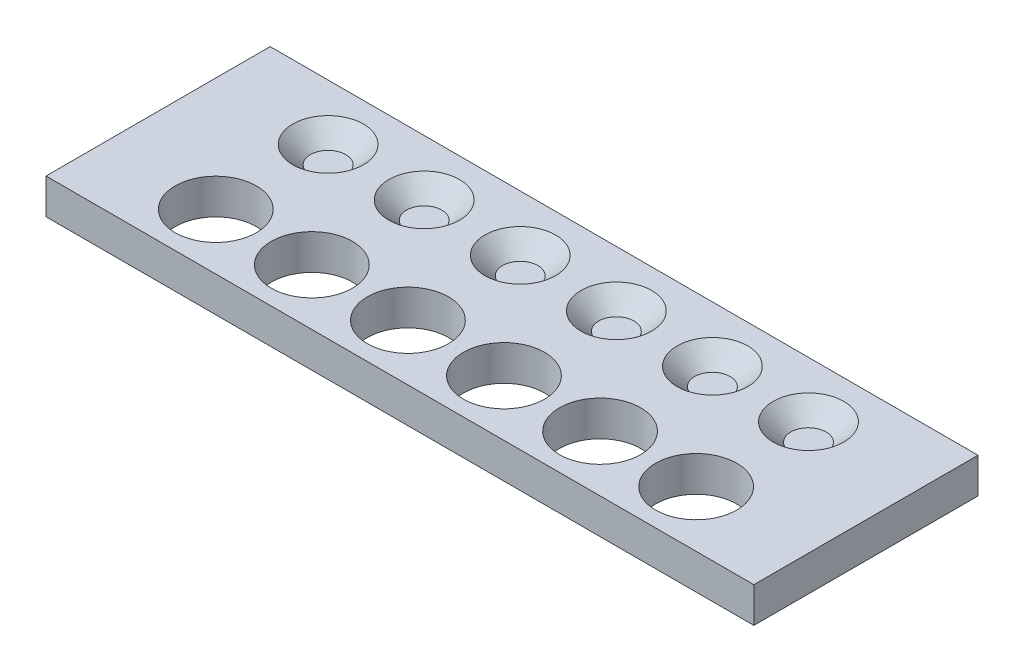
ISO-10303-21;
HEADER;
FILE_DESCRIPTION(('STEP AP214'),'2;1');
FILE_NAME('part.step','',(''),(''),'','','');
FILE_SCHEMA(('AUTOMOTIVE_DESIGN { 1 0 10303 214 1 1 1 1 }'));
ENDSEC;
DATA;
#1=APPLICATION_CONTEXT('core data for automotive mechanical design processes');
#2=APPLICATION_PROTOCOL_DEFINITION('international standard','automotive_design',2000,#1);
#3=PRODUCT_CONTEXT('',#1,'mechanical');
#4=PRODUCT('Part','Part','',(#3));
#5=PRODUCT_RELATED_PRODUCT_CATEGORY('part','',(#4));
#6=PRODUCT_DEFINITION_FORMATION('','',#4);
#7=PRODUCT_DEFINITION_CONTEXT('part definition',#1,'design');
#8=PRODUCT_DEFINITION('design','',#6,#7);
#9=PRODUCT_DEFINITION_SHAPE('','',#8);
#10=(LENGTH_UNIT() NAMED_UNIT(*) SI_UNIT(.MILLI.,.METRE.));
#11=(NAMED_UNIT(*) PLANE_ANGLE_UNIT() SI_UNIT($,.RADIAN.));
#12=(NAMED_UNIT(*) SI_UNIT($,.STERADIAN.) SOLID_ANGLE_UNIT());
#13=UNCERTAINTY_MEASURE_WITH_UNIT(LENGTH_MEASURE(1.E-05),#10,'distance_accuracy_value','');
#14=(GEOMETRIC_REPRESENTATION_CONTEXT(3) GLOBAL_UNCERTAINTY_ASSIGNED_CONTEXT((#13)) GLOBAL_UNIT_ASSIGNED_CONTEXT((#10,
#11,#12)) REPRESENTATION_CONTEXT('',''));
#15=CARTESIAN_POINT('',(0.,0.,0.));
#16=DIRECTION('',(0.,0.,1.));
#17=DIRECTION('',(1.,0.,0.));
#18=AXIS2_PLACEMENT_3D('',#15,#16,#17);
#19=CARTESIAN_POINT('',(-55.2242907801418,10.,-42.81280535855));
#20=DIRECTION('',(0.,-1.,0.));
#21=DIRECTION('',(0.,0.,-1.));
#22=AXIS2_PLACEMENT_3D('',#19,#20,#21);
#23=PLANE('',#22);
#24=CARTESIAN_POINT('',(108.050871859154,10.,-27.0217559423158));
#25=DIRECTION('',(0.,-1.,0.));
#26=DIRECTION('',(0.,0.,-1.));
#27=AXIS2_PLACEMENT_3D('',#24,#25,#26);
#28=CIRCLE('',#27,10.);
#29=CARTESIAN_POINT('',(108.050871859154,10.,-37.0217559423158));
#30=VERTEX_POINT('',#29);
#31=EDGE_CURVE('E11',#30,#30,#28,.T.);
#32=ORIENTED_EDGE('',*,*,#31,.T.);
#33=EDGE_LOOP('',(#32));
#34=FACE_BOUND('',#33,.T.);
#35=CARTESIAN_POINT('',(80.8366718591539,10.,-27.0217559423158));
#36=DIRECTION('',(0.,-1.,0.));
#37=DIRECTION('',(0.,0.,-1.));
#38=AXIS2_PLACEMENT_3D('',#35,#36,#37);
#39=CIRCLE('',#38,10.);
#40=CARTESIAN_POINT('',(80.8366718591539,10.,-37.0217559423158));
#41=VERTEX_POINT('',#40);
#42=EDGE_CURVE('E40',#41,#41,#39,.T.);
#43=ORIENTED_EDGE('',*,*,#42,.T.);
#44=EDGE_LOOP('',(#43));
#45=FACE_BOUND('',#44,.T.);
#46=CARTESIAN_POINT('',(53.6224718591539,10.,-27.0217559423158));
#47=DIRECTION('',(0.,-1.,0.));
#48=DIRECTION('',(0.,0.,-1.));
#49=AXIS2_PLACEMENT_3D('',#46,#47,#48);
#50=CIRCLE('',#49,10.);
#51=CARTESIAN_POINT('',(53.6224718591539,10.,-37.0217559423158));
#52=VERTEX_POINT('',#51);
#53=EDGE_CURVE('E171',#52,#52,#50,.T.);
#54=ORIENTED_EDGE('',*,*,#53,.T.);
#55=EDGE_LOOP('',(#54));
#56=FACE_BOUND('',#55,.T.);
#57=CARTESIAN_POINT('',(26.4076718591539,10.,-27.0217559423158));
#58=DIRECTION('',(0.,-1.,0.));
#59=DIRECTION('',(0.,0.,-1.));
#60=AXIS2_PLACEMENT_3D('',#57,#58,#59);
#61=CIRCLE('',#60,10.);
#62=CARTESIAN_POINT('',(26.4076718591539,10.,-37.0217559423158));
#63=VERTEX_POINT('',#62);
#64=EDGE_CURVE('E168',#63,#63,#61,.T.);
#65=ORIENTED_EDGE('',*,*,#64,.T.);
#66=EDGE_LOOP('',(#65));
#67=FACE_BOUND('',#66,.T.);
#68=CARTESIAN_POINT('',(-0.806528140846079,10.,-27.0217559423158));
#69=DIRECTION('',(0.,-1.,0.));
#70=DIRECTION('',(0.,0.,-1.));
#71=AXIS2_PLACEMENT_3D('',#68,#69,#70);
#72=CIRCLE('',#71,10.);
#73=CARTESIAN_POINT('',(-0.806528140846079,10.,-37.0217559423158));
#74=VERTEX_POINT('',#73);
#75=EDGE_CURVE('E165',#74,#74,#72,.T.);
#76=ORIENTED_EDGE('',*,*,#75,.T.);
#77=EDGE_LOOP('',(#76));
#78=FACE_BOUND('',#77,.T.);
#79=CARTESIAN_POINT('',(-28.0207281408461,10.,-27.0217559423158));
#80=DIRECTION('',(0.,-1.,0.));
#81=DIRECTION('',(0.,0.,-1.));
#82=AXIS2_PLACEMENT_3D('',#79,#80,#81);
#83=CIRCLE('',#82,10.);
#84=CARTESIAN_POINT('',(-28.0207281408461,10.,-37.0217559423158));
#85=VERTEX_POINT('',#84);
#86=EDGE_CURVE('E161',#85,#85,#83,.T.);
#87=ORIENTED_EDGE('',*,*,#86,.T.);
#88=EDGE_LOOP('',(#87));
#89=FACE_BOUND('',#88,.T.);
#90=CARTESIAN_POINT('',(80.8473092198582,10.,4.81219464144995));
#91=DIRECTION('',(0.,1.,0.));
#92=DIRECTION('',(0.,0.,1.));
#93=AXIS2_PLACEMENT_3D('',#90,#91,#92);
#94=CIRCLE('',#93,11.5);
#95=CARTESIAN_POINT('',(80.8473092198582,10.,16.3121946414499));
#96=VERTEX_POINT('',#95);
#97=EDGE_CURVE('E130',#96,#96,#94,.T.);
#98=ORIENTED_EDGE('',*,*,#97,.F.);
#99=EDGE_LOOP('',(#98));
#100=FACE_BOUND('',#99,.T.);
#101=CARTESIAN_POINT('',(26.4183092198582,10.,4.81219464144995));
#102=DIRECTION('',(0.,1.,0.));
#103=DIRECTION('',(0.,0.,1.));
#104=AXIS2_PLACEMENT_3D('',#101,#102,#103);
#105=CIRCLE('',#104,11.5);
#106=CARTESIAN_POINT('',(26.4183092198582,10.,16.3121946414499));
#107=VERTEX_POINT('',#106);
#108=EDGE_CURVE('E142',#107,#107,#105,.T.);
#109=ORIENTED_EDGE('',*,*,#108,.F.);
#110=EDGE_LOOP('',(#109));
#111=FACE_BOUND('',#110,.T.);
#112=CARTESIAN_POINT('',(-28.0100907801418,10.,4.81219464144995));
#113=DIRECTION('',(0.,1.,0.));
#114=DIRECTION('',(0.,0.,1.));
#115=AXIS2_PLACEMENT_3D('',#112,#113,#114);
#116=CIRCLE('',#115,11.5);
#117=CARTESIAN_POINT('',(-28.0100907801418,10.,16.3121946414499));
#118=VERTEX_POINT('',#117);
#119=EDGE_CURVE('E154',#118,#118,#116,.T.);
#120=ORIENTED_EDGE('',*,*,#119,.F.);
#121=EDGE_LOOP('',(#120));
#122=FACE_BOUND('',#121,.T.);
#123=DIRECTION('',(-1.,0.,0.));
#124=VECTOR('',#123,1.);
#125=CARTESIAN_POINT('',(-55.2242907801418,10.,-42.81280535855));
#126=LINE('',#125,#124);
#127=CARTESIAN_POINT('',(140.275709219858,10.,-42.81280535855));
#128=VERTEX_POINT('',#127);
#129=CARTESIAN_POINT('',(-60.2242907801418,10.,-42.81280535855));
#130=VERTEX_POINT('',#129);
#131=EDGE_CURVE('E66',#128,#130,#126,.T.);
#132=ORIENTED_EDGE('',*,*,#131,.T.);
#133=DIRECTION('',(0.,0.,1.));
#134=VECTOR('',#133,1.);
#135=CARTESIAN_POINT('',(-60.2242907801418,10.,-42.81280535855));
#136=LINE('',#135,#134);
#137=CARTESIAN_POINT('',(-60.2242907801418,10.,20.68719464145));
#138=VERTEX_POINT('',#137);
#139=EDGE_CURVE('E98',#130,#138,#136,.T.);
#140=ORIENTED_EDGE('',*,*,#139,.T.);
#141=DIRECTION('',(1.,0.,0.));
#142=VECTOR('',#141,1.);
#143=CARTESIAN_POINT('',(-55.2242907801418,10.,20.68719464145));
#144=LINE('',#143,#142);
#145=CARTESIAN_POINT('',(140.275709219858,10.,20.68719464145));
#146=VERTEX_POINT('',#145);
#147=EDGE_CURVE('E48',#138,#146,#144,.T.);
#148=ORIENTED_EDGE('',*,*,#147,.T.);
#149=DIRECTION('',(0.,0.,-1.));
#150=VECTOR('',#149,1.);
#151=CARTESIAN_POINT('',(140.275709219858,10.,-42.81280535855));
#152=LINE('',#151,#150);
#153=EDGE_CURVE('E91',#146,#128,#152,.T.);
#154=ORIENTED_EDGE('',*,*,#153,.T.);
#155=EDGE_LOOP('',(#132,#140,#148,#154));
#156=FACE_BOUND('',#155,.T.);
#157=CARTESIAN_POINT('',(-0.795890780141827,10.,4.81219464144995));
#158=DIRECTION('',(0.,1.,0.));
#159=DIRECTION('',(0.,0.,1.));
#160=AXIS2_PLACEMENT_3D('',#157,#158,#159);
#161=CIRCLE('',#160,11.5);
#162=CARTESIAN_POINT('',(-0.795890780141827,10.,16.31219464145));
#163=VERTEX_POINT('',#162);
#164=EDGE_CURVE('E148',#163,#163,#161,.T.);
#165=ORIENTED_EDGE('',*,*,#164,.F.);
#166=EDGE_LOOP('',(#165));
#167=FACE_BOUND('',#166,.T.);
#168=CARTESIAN_POINT('',(53.6331092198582,10.,4.81219464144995));
#169=DIRECTION('',(0.,1.,0.));
#170=DIRECTION('',(0.,0.,1.));
#171=AXIS2_PLACEMENT_3D('',#168,#169,#170);
#172=CIRCLE('',#171,11.5);
#173=CARTESIAN_POINT('',(53.6331092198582,10.,16.3121946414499));
#174=VERTEX_POINT('',#173);
#175=EDGE_CURVE('E136',#174,#174,#172,.T.);
#176=ORIENTED_EDGE('',*,*,#175,.F.);
#177=EDGE_LOOP('',(#176));
#178=FACE_BOUND('',#177,.T.);
#179=CARTESIAN_POINT('',(108.061509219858,10.,4.81219464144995));
#180=DIRECTION('',(0.,1.,0.));
#181=DIRECTION('',(0.,0.,1.));
#182=AXIS2_PLACEMENT_3D('',#179,#180,#181);
#183=CIRCLE('',#182,11.5);
#184=CARTESIAN_POINT('',(108.061509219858,10.,16.3121946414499));
#185=VERTEX_POINT('',#184);
#186=EDGE_CURVE('E124',#185,#185,#183,.T.);
#187=ORIENTED_EDGE('',*,*,#186,.F.);
#188=EDGE_LOOP('',(#187));
#189=FACE_BOUND('',#188,.T.);
#190=ADVANCED_FACE('F31',(#34,#45,#56,#67,#78,#89,#100,#111,#122,#156,#167,#178,#189),#23,.F.);
#191=CARTESIAN_POINT('',(-55.2242907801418,0.,-42.81280535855));
#192=DIRECTION('',(0.,-1.,0.));
#193=DIRECTION('',(0.,0.,-1.));
#194=AXIS2_PLACEMENT_3D('',#191,#192,#193);
#195=PLANE('',#194);
#196=CARTESIAN_POINT('',(80.8473092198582,0.,4.81219464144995));
#197=DIRECTION('',(0.,1.,0.));
#198=DIRECTION('',(0.,0.,1.));
#199=AXIS2_PLACEMENT_3D('',#196,#197,#198);
#200=CIRCLE('',#199,11.5);
#201=CARTESIAN_POINT('',(80.8473092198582,0.,16.3121946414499));
#202=VERTEX_POINT('',#201);
#203=EDGE_CURVE('E127',#202,#202,#200,.T.);
#204=ORIENTED_EDGE('',*,*,#203,.T.);
#205=EDGE_LOOP('',(#204));
#206=FACE_BOUND('',#205,.T.);
#207=CARTESIAN_POINT('',(26.4183092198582,0.,4.81219464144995));
#208=DIRECTION('',(0.,1.,0.));
#209=DIRECTION('',(0.,0.,1.));
#210=AXIS2_PLACEMENT_3D('',#207,#208,#209);
#211=CIRCLE('',#210,11.5);
#212=CARTESIAN_POINT('',(26.4183092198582,0.,16.3121946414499));
#213=VERTEX_POINT('',#212);
#214=EDGE_CURVE('E139',#213,#213,#211,.T.);
#215=ORIENTED_EDGE('',*,*,#214,.T.);
#216=EDGE_LOOP('',(#215));
#217=FACE_BOUND('',#216,.T.);
#218=CARTESIAN_POINT('',(-28.0100907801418,0.,4.81219464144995));
#219=DIRECTION('',(0.,1.,0.));
#220=DIRECTION('',(0.,0.,1.));
#221=AXIS2_PLACEMENT_3D('',#218,#219,#220);
#222=CIRCLE('',#221,11.5);
#223=CARTESIAN_POINT('',(-28.0100907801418,0.,16.3121946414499));
#224=VERTEX_POINT('',#223);
#225=EDGE_CURVE('E151',#224,#224,#222,.T.);
#226=ORIENTED_EDGE('',*,*,#225,.T.);
#227=EDGE_LOOP('',(#226));
#228=FACE_BOUND('',#227,.T.);
#229=DIRECTION('',(1.,0.,0.));
#230=VECTOR('',#229,1.);
#231=CARTESIAN_POINT('',(-55.2242907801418,0.,20.68719464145));
#232=LINE('',#231,#230);
#233=CARTESIAN_POINT('',(-60.2242907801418,0.,20.68719464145));
#234=VERTEX_POINT('',#233);
#235=CARTESIAN_POINT('',(140.275709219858,0.,20.68719464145));
#236=VERTEX_POINT('',#235);
#237=EDGE_CURVE('E82',#234,#236,#232,.T.);
#238=ORIENTED_EDGE('',*,*,#237,.F.);
#239=DIRECTION('',(0.,0.,1.));
#240=VECTOR('',#239,1.);
#241=CARTESIAN_POINT('',(-60.2242907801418,0.,-42.81280535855));
#242=LINE('',#241,#240);
#243=CARTESIAN_POINT('',(-60.2242907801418,0.,-42.81280535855));
#244=VERTEX_POINT('',#243);
#245=EDGE_CURVE('E81',#244,#234,#242,.T.);
#246=ORIENTED_EDGE('',*,*,#245,.F.);
#247=DIRECTION('',(-1.,0.,0.));
#248=VECTOR('',#247,1.);
#249=CARTESIAN_POINT('',(-55.2242907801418,0.,-42.81280535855));
#250=LINE('',#249,#248);
#251=CARTESIAN_POINT('',(140.275709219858,0.,-42.81280535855));
#252=VERTEX_POINT('',#251);
#253=EDGE_CURVE('E60',#252,#244,#250,.T.);
#254=ORIENTED_EDGE('',*,*,#253,.F.);
#255=DIRECTION('',(0.,0.,-1.));
#256=VECTOR('',#255,1.);
#257=CARTESIAN_POINT('',(140.275709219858,0.,-42.81280535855));
#258=LINE('',#257,#256);
#259=EDGE_CURVE('E79',#236,#252,#258,.T.);
#260=ORIENTED_EDGE('',*,*,#259,.F.);
#261=EDGE_LOOP('',(#238,#246,#254,#260));
#262=FACE_BOUND('',#261,.T.);
#263=CARTESIAN_POINT('',(-0.795890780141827,0.,4.81219464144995));
#264=DIRECTION('',(0.,1.,0.));
#265=DIRECTION('',(0.,0.,1.));
#266=AXIS2_PLACEMENT_3D('',#263,#264,#265);
#267=CIRCLE('',#266,11.5);
#268=CARTESIAN_POINT('',(-0.795890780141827,0.,16.31219464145));
#269=VERTEX_POINT('',#268);
#270=EDGE_CURVE('E145',#269,#269,#267,.T.);
#271=ORIENTED_EDGE('',*,*,#270,.T.);
#272=EDGE_LOOP('',(#271));
#273=FACE_BOUND('',#272,.T.);
#274=CARTESIAN_POINT('',(53.6331092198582,0.,4.81219464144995));
#275=DIRECTION('',(0.,1.,0.));
#276=DIRECTION('',(0.,0.,1.));
#277=AXIS2_PLACEMENT_3D('',#274,#275,#276);
#278=CIRCLE('',#277,11.5);
#279=CARTESIAN_POINT('',(53.6331092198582,0.,16.3121946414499));
#280=VERTEX_POINT('',#279);
#281=EDGE_CURVE('E133',#280,#280,#278,.T.);
#282=ORIENTED_EDGE('',*,*,#281,.T.);
#283=EDGE_LOOP('',(#282));
#284=FACE_BOUND('',#283,.T.);
#285=CARTESIAN_POINT('',(108.061509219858,0.,4.81219464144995));
#286=DIRECTION('',(0.,1.,0.));
#287=DIRECTION('',(0.,0.,1.));
#288=AXIS2_PLACEMENT_3D('',#285,#286,#287);
#289=CIRCLE('',#288,11.5);
#290=CARTESIAN_POINT('',(108.061509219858,0.,16.3121946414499));
#291=VERTEX_POINT('',#290);
#292=EDGE_CURVE('E123',#291,#291,#289,.T.);
#293=ORIENTED_EDGE('',*,*,#292,.T.);
#294=EDGE_LOOP('',(#293));
#295=FACE_BOUND('',#294,.T.);
#296=ADVANCED_FACE('F77',(#206,#217,#228,#262,#273,#284,#295),#195,.T.);
#297=CARTESIAN_POINT('',(-55.2242907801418,10.,20.68719464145));
#298=DIRECTION('',(0.,0.,-1.));
#299=DIRECTION('',(-1.,0.,0.));
#300=AXIS2_PLACEMENT_3D('',#297,#298,#299);
#301=PLANE('',#300);
#302=ORIENTED_EDGE('',*,*,#237,.T.);
#303=DIRECTION('',(0.,-1.,0.));
#304=VECTOR('',#303,1.);
#305=CARTESIAN_POINT('',(140.275709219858,10.,20.68719464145));
#306=LINE('',#305,#304);
#307=EDGE_CURVE('E90',#146,#236,#306,.T.);
#308=ORIENTED_EDGE('',*,*,#307,.F.);
#309=ORIENTED_EDGE('',*,*,#147,.F.);
#310=DIRECTION('',(0.,-1.,0.));
#311=VECTOR('',#310,1.);
#312=CARTESIAN_POINT('',(-60.2242907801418,10.,20.68719464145));
#313=LINE('',#312,#311);
#314=EDGE_CURVE('E100',#138,#234,#313,.T.);
#315=ORIENTED_EDGE('',*,*,#314,.T.);
#316=EDGE_LOOP('',(#302,#308,#309,#315));
#317=FACE_BOUND('',#316,.T.);
#318=ADVANCED_FACE('F206',(#317),#301,.F.);
#319=CARTESIAN_POINT('',(-55.2242907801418,10.,-42.81280535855));
#320=DIRECTION('',(0.,0.,1.));
#321=DIRECTION('',(1.,0.,0.));
#322=AXIS2_PLACEMENT_3D('',#319,#320,#321);
#323=PLANE('',#322);
#324=ORIENTED_EDGE('',*,*,#253,.T.);
#325=DIRECTION('',(0.,-1.,0.));
#326=VECTOR('',#325,1.);
#327=CARTESIAN_POINT('',(-60.2242907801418,10.,-42.81280535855));
#328=LINE('',#327,#326);
#329=EDGE_CURVE('E103',#130,#244,#328,.T.);
#330=ORIENTED_EDGE('',*,*,#329,.F.);
#331=ORIENTED_EDGE('',*,*,#131,.F.);
#332=DIRECTION('',(0.,-1.,0.));
#333=VECTOR('',#332,1.);
#334=CARTESIAN_POINT('',(140.275709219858,10.,-42.81280535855));
#335=LINE('',#334,#333);
#336=EDGE_CURVE('E89',#128,#252,#335,.T.);
#337=ORIENTED_EDGE('',*,*,#336,.T.);
#338=EDGE_LOOP('',(#324,#330,#331,#337));
#339=FACE_BOUND('',#338,.T.);
#340=ADVANCED_FACE('F93',(#339),#323,.F.);
#341=CARTESIAN_POINT('',(-28.0100907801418,10.,4.81219464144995));
#342=DIRECTION('',(0.,-1.,0.));
#343=DIRECTION('',(0.,0.,-1.));
#344=AXIS2_PLACEMENT_3D('',#341,#342,#343);
#345=CYLINDRICAL_SURFACE('',#344,11.5);
#346=ORIENTED_EDGE('',*,*,#119,.T.);
#347=EDGE_LOOP('',(#346));
#348=FACE_BOUND('',#347,.T.);
#349=ORIENTED_EDGE('',*,*,#225,.F.);
#350=EDGE_LOOP('',(#349));
#351=FACE_BOUND('',#350,.T.);
#352=ADVANCED_FACE('F210',(#348,#351),#345,.F.);
#353=CARTESIAN_POINT('',(-0.795890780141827,10.,4.81219464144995));
#354=DIRECTION('',(0.,-1.,0.));
#355=DIRECTION('',(0.,0.,-1.));
#356=AXIS2_PLACEMENT_3D('',#353,#354,#355);
#357=CYLINDRICAL_SURFACE('',#356,11.5);
#358=ORIENTED_EDGE('',*,*,#164,.T.);
#359=EDGE_LOOP('',(#358));
#360=FACE_BOUND('',#359,.T.);
#361=ORIENTED_EDGE('',*,*,#270,.F.);
#362=EDGE_LOOP('',(#361));
#363=FACE_BOUND('',#362,.T.);
#364=ADVANCED_FACE('F265',(#360,#363),#357,.F.);
#365=CARTESIAN_POINT('',(26.4183092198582,10.,4.81219464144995));
#366=DIRECTION('',(0.,-1.,0.));
#367=DIRECTION('',(0.,0.,-1.));
#368=AXIS2_PLACEMENT_3D('',#365,#366,#367);
#369=CYLINDRICAL_SURFACE('',#368,11.5);
#370=ORIENTED_EDGE('',*,*,#108,.T.);
#371=EDGE_LOOP('',(#370));
#372=FACE_BOUND('',#371,.T.);
#373=ORIENTED_EDGE('',*,*,#214,.F.);
#374=EDGE_LOOP('',(#373));
#375=FACE_BOUND('',#374,.T.);
#376=ADVANCED_FACE('F262',(#372,#375),#369,.F.);
#377=CARTESIAN_POINT('',(53.6331092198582,10.,4.81219464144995));
#378=DIRECTION('',(0.,-1.,0.));
#379=DIRECTION('',(0.,0.,-1.));
#380=AXIS2_PLACEMENT_3D('',#377,#378,#379);
#381=CYLINDRICAL_SURFACE('',#380,11.5);
#382=ORIENTED_EDGE('',*,*,#175,.T.);
#383=EDGE_LOOP('',(#382));
#384=FACE_BOUND('',#383,.T.);
#385=ORIENTED_EDGE('',*,*,#281,.F.);
#386=EDGE_LOOP('',(#385));
#387=FACE_BOUND('',#386,.T.);
#388=ADVANCED_FACE('F258',(#384,#387),#381,.F.);
#389=CARTESIAN_POINT('',(80.8473092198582,10.,4.81219464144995));
#390=DIRECTION('',(0.,-1.,0.));
#391=DIRECTION('',(0.,0.,-1.));
#392=AXIS2_PLACEMENT_3D('',#389,#390,#391);
#393=CYLINDRICAL_SURFACE('',#392,11.5);
#394=ORIENTED_EDGE('',*,*,#97,.T.);
#395=EDGE_LOOP('',(#394));
#396=FACE_BOUND('',#395,.T.);
#397=ORIENTED_EDGE('',*,*,#203,.F.);
#398=EDGE_LOOP('',(#397));
#399=FACE_BOUND('',#398,.T.);
#400=ADVANCED_FACE('F254',(#396,#399),#393,.F.);
#401=CARTESIAN_POINT('',(108.061509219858,10.,4.81219464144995));
#402=DIRECTION('',(0.,-1.,0.));
#403=DIRECTION('',(0.,0.,-1.));
#404=AXIS2_PLACEMENT_3D('',#401,#402,#403);
#405=CYLINDRICAL_SURFACE('',#404,11.5);
#406=ORIENTED_EDGE('',*,*,#186,.T.);
#407=EDGE_LOOP('',(#406));
#408=FACE_BOUND('',#407,.T.);
#409=ORIENTED_EDGE('',*,*,#292,.F.);
#410=EDGE_LOOP('',(#409));
#411=FACE_BOUND('',#410,.T.);
#412=ADVANCED_FACE('F248',(#408,#411),#405,.F.);
#413=CARTESIAN_POINT('',(-28.0207281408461,5.,-27.0217559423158));
#414=DIRECTION('',(0.,1.,0.));
#415=DIRECTION('',(0.,0.,1.));
#416=AXIS2_PLACEMENT_3D('',#413,#414,#415);
#417=PLANE('',#416);
#418=CARTESIAN_POINT('',(-28.0207281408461,5.,-27.0217559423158));
#419=DIRECTION('',(0.,1.,0.));
#420=DIRECTION('',(0.,0.,1.));
#421=AXIS2_PLACEMENT_3D('',#418,#419,#420);
#422=CIRCLE('',#421,5.);
#423=CARTESIAN_POINT('',(-28.0207281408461,5.,-22.0217559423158));
#424=VERTEX_POINT('',#423);
#425=EDGE_CURVE('E120',#424,#424,#422,.T.);
#426=ORIENTED_EDGE('',*,*,#425,.T.);
#427=EDGE_LOOP('',(#426));
#428=FACE_BOUND('',#427,.T.);
#429=ADVANCED_FACE('F240',(#428),#417,.T.);
#430=CARTESIAN_POINT('',(-0.806528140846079,5.,-27.0217559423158));
#431=DIRECTION('',(0.,1.,0.));
#432=DIRECTION('',(0.,0.,1.));
#433=AXIS2_PLACEMENT_3D('',#430,#431,#432);
#434=PLANE('',#433);
#435=CARTESIAN_POINT('',(-0.806528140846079,5.,-27.0217559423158));
#436=DIRECTION('',(0.,1.,0.));
#437=DIRECTION('',(0.,0.,1.));
#438=AXIS2_PLACEMENT_3D('',#435,#436,#437);
#439=CIRCLE('',#438,5.);
#440=CARTESIAN_POINT('',(-0.806528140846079,5.,-22.0217559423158));
#441=VERTEX_POINT('',#440);
#442=EDGE_CURVE('E117',#441,#441,#439,.T.);
#443=ORIENTED_EDGE('',*,*,#442,.T.);
#444=EDGE_LOOP('',(#443));
#445=FACE_BOUND('',#444,.T.);
#446=ADVANCED_FACE('F238',(#445),#434,.T.);
#447=CARTESIAN_POINT('',(26.4076718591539,5.,-27.0217559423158));
#448=DIRECTION('',(0.,1.,0.));
#449=DIRECTION('',(0.,0.,1.));
#450=AXIS2_PLACEMENT_3D('',#447,#448,#449);
#451=PLANE('',#450);
#452=CARTESIAN_POINT('',(26.4076718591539,5.,-27.0217559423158));
#453=DIRECTION('',(0.,1.,0.));
#454=DIRECTION('',(0.,0.,1.));
#455=AXIS2_PLACEMENT_3D('',#452,#453,#454);
#456=CIRCLE('',#455,5.);
#457=CARTESIAN_POINT('',(26.4076718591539,5.,-22.0217559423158));
#458=VERTEX_POINT('',#457);
#459=EDGE_CURVE('E114',#458,#458,#456,.T.);
#460=ORIENTED_EDGE('',*,*,#459,.T.);
#461=EDGE_LOOP('',(#460));
#462=FACE_BOUND('',#461,.T.);
#463=ADVANCED_FACE('F197',(#462),#451,.T.);
#464=CARTESIAN_POINT('',(53.6224718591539,5.,-27.0217559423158));
#465=DIRECTION('',(0.,1.,0.));
#466=DIRECTION('',(0.,0.,1.));
#467=AXIS2_PLACEMENT_3D('',#464,#465,#466);
#468=PLANE('',#467);
#469=CARTESIAN_POINT('',(53.6224718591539,5.,-27.0217559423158));
#470=DIRECTION('',(0.,1.,0.));
#471=DIRECTION('',(0.,0.,1.));
#472=AXIS2_PLACEMENT_3D('',#469,#470,#471);
#473=CIRCLE('',#472,5.);
#474=CARTESIAN_POINT('',(53.6224718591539,5.,-22.0217559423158));
#475=VERTEX_POINT('',#474);
#476=EDGE_CURVE('E111',#475,#475,#473,.T.);
#477=ORIENTED_EDGE('',*,*,#476,.T.);
#478=EDGE_LOOP('',(#477));
#479=FACE_BOUND('',#478,.T.);
#480=ADVANCED_FACE('F189',(#479),#468,.T.);
#481=CARTESIAN_POINT('',(80.8366718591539,5.,-27.0217559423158));
#482=DIRECTION('',(0.,1.,0.));
#483=DIRECTION('',(0.,0.,1.));
#484=AXIS2_PLACEMENT_3D('',#481,#482,#483);
#485=PLANE('',#484);
#486=CARTESIAN_POINT('',(80.8366718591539,5.,-27.0217559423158));
#487=DIRECTION('',(0.,1.,0.));
#488=DIRECTION('',(0.,0.,1.));
#489=AXIS2_PLACEMENT_3D('',#486,#487,#488);
#490=CIRCLE('',#489,5.);
#491=CARTESIAN_POINT('',(80.8366718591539,5.,-22.0217559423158));
#492=VERTEX_POINT('',#491);
#493=EDGE_CURVE('E108',#492,#492,#490,.T.);
#494=ORIENTED_EDGE('',*,*,#493,.T.);
#495=EDGE_LOOP('',(#494));
#496=FACE_BOUND('',#495,.T.);
#497=ADVANCED_FACE('F186',(#496),#485,.T.);
#498=CARTESIAN_POINT('',(108.050871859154,5.,-27.0217559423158));
#499=DIRECTION('',(0.,1.,0.));
#500=DIRECTION('',(0.,0.,1.));
#501=AXIS2_PLACEMENT_3D('',#498,#499,#500);
#502=PLANE('',#501);
#503=CARTESIAN_POINT('',(108.050871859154,5.,-27.0217559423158));
#504=DIRECTION('',(0.,1.,0.));
#505=DIRECTION('',(0.,0.,1.));
#506=AXIS2_PLACEMENT_3D('',#503,#504,#505);
#507=CIRCLE('',#506,5.);
#508=CARTESIAN_POINT('',(108.050871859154,5.,-22.0217559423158));
#509=VERTEX_POINT('',#508);
#510=EDGE_CURVE('E105',#509,#509,#507,.T.);
#511=ORIENTED_EDGE('',*,*,#510,.T.);
#512=EDGE_LOOP('',(#511));
#513=FACE_BOUND('',#512,.T.);
#514=ADVANCED_FACE('F188',(#513),#502,.T.);
#515=CARTESIAN_POINT('',(108.050871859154,5.00000000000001,-27.0217559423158));
#516=DIRECTION('',(0.,1.,0.));
#517=DIRECTION('',(0.,0.,1.));
#518=AXIS2_PLACEMENT_3D('',#515,#516,#517);
#519=CONICAL_SURFACE('',#518,5.,0.785398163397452);
#520=ORIENTED_EDGE('',*,*,#31,.F.);
#521=EDGE_LOOP('',(#520));
#522=FACE_BOUND('',#521,.T.);
#523=ORIENTED_EDGE('',*,*,#510,.F.);
#524=EDGE_LOOP('',(#523));
#525=FACE_BOUND('',#524,.T.);
#526=ADVANCED_FACE('F182',(#522,#525),#519,.F.);
#527=CARTESIAN_POINT('',(80.8366718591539,5.00000000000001,-27.0217559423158));
#528=DIRECTION('',(0.,1.,0.));
#529=DIRECTION('',(0.,0.,1.));
#530=AXIS2_PLACEMENT_3D('',#527,#528,#529);
#531=CONICAL_SURFACE('',#530,5.,0.785398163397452);
#532=ORIENTED_EDGE('',*,*,#42,.F.);
#533=EDGE_LOOP('',(#532));
#534=FACE_BOUND('',#533,.T.);
#535=ORIENTED_EDGE('',*,*,#493,.F.);
#536=EDGE_LOOP('',(#535));
#537=FACE_BOUND('',#536,.T.);
#538=ADVANCED_FACE('F178',(#534,#537),#531,.F.);
#539=CARTESIAN_POINT('',(53.6224718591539,5.,-27.0217559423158));
#540=DIRECTION('',(0.,1.,0.));
#541=DIRECTION('',(0.,0.,1.));
#542=AXIS2_PLACEMENT_3D('',#539,#540,#541);
#543=CONICAL_SURFACE('',#542,5.,0.785398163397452);
#544=ORIENTED_EDGE('',*,*,#53,.F.);
#545=EDGE_LOOP('',(#544));
#546=FACE_BOUND('',#545,.T.);
#547=ORIENTED_EDGE('',*,*,#476,.F.);
#548=EDGE_LOOP('',(#547));
#549=FACE_BOUND('',#548,.T.);
#550=ADVANCED_FACE('F181',(#546,#549),#543,.F.);
#551=CARTESIAN_POINT('',(26.4076718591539,5.,-27.0217559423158));
#552=DIRECTION('',(0.,1.,0.));
#553=DIRECTION('',(0.,0.,1.));
#554=AXIS2_PLACEMENT_3D('',#551,#552,#553);
#555=CONICAL_SURFACE('',#554,5.,0.785398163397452);
#556=ORIENTED_EDGE('',*,*,#64,.F.);
#557=EDGE_LOOP('',(#556));
#558=FACE_BOUND('',#557,.T.);
#559=ORIENTED_EDGE('',*,*,#459,.F.);
#560=EDGE_LOOP('',(#559));
#561=FACE_BOUND('',#560,.T.);
#562=ADVANCED_FACE('F222',(#558,#561),#555,.F.);
#563=CARTESIAN_POINT('',(-0.806528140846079,5.,-27.0217559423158));
#564=DIRECTION('',(0.,1.,0.));
#565=DIRECTION('',(0.,0.,1.));
#566=AXIS2_PLACEMENT_3D('',#563,#564,#565);
#567=CONICAL_SURFACE('',#566,5.,0.785398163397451);
#568=ORIENTED_EDGE('',*,*,#75,.F.);
#569=EDGE_LOOP('',(#568));
#570=FACE_BOUND('',#569,.T.);
#571=ORIENTED_EDGE('',*,*,#442,.F.);
#572=EDGE_LOOP('',(#571));
#573=FACE_BOUND('',#572,.T.);
#574=ADVANCED_FACE('F225',(#570,#573),#567,.F.);
#575=CARTESIAN_POINT('',(-28.0207281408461,5.,-27.0217559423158));
#576=DIRECTION('',(0.,1.,0.));
#577=DIRECTION('',(0.,0.,1.));
#578=AXIS2_PLACEMENT_3D('',#575,#576,#577);
#579=CONICAL_SURFACE('',#578,5.,0.785398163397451);
#580=ORIENTED_EDGE('',*,*,#86,.F.);
#581=EDGE_LOOP('',(#580));
#582=FACE_BOUND('',#581,.T.);
#583=ORIENTED_EDGE('',*,*,#425,.F.);
#584=EDGE_LOOP('',(#583));
#585=FACE_BOUND('',#584,.T.);
#586=ADVANCED_FACE('F33',(#582,#585),#579,.F.);
#587=CARTESIAN_POINT('',(-60.2242907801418,10.,-42.81280535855));
#588=DIRECTION('',(1.,0.,0.));
#589=DIRECTION('',(0.,0.,-1.));
#590=AXIS2_PLACEMENT_3D('',#587,#588,#589);
#591=PLANE('',#590);
#592=ORIENTED_EDGE('',*,*,#245,.T.);
#593=ORIENTED_EDGE('',*,*,#314,.F.);
#594=ORIENTED_EDGE('',*,*,#139,.F.);
#595=ORIENTED_EDGE('',*,*,#329,.T.);
#596=EDGE_LOOP('',(#592,#593,#594,#595));
#597=FACE_BOUND('',#596,.T.);
#598=ADVANCED_FACE('F232',(#597),#591,.F.);
#599=CARTESIAN_POINT('',(140.275709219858,10.,-42.81280535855));
#600=DIRECTION('',(-1.,0.,0.));
#601=DIRECTION('',(0.,0.,1.));
#602=AXIS2_PLACEMENT_3D('',#599,#600,#601);
#603=PLANE('',#602);
#604=ORIENTED_EDGE('',*,*,#259,.T.);
#605=ORIENTED_EDGE('',*,*,#336,.F.);
#606=ORIENTED_EDGE('',*,*,#153,.F.);
#607=ORIENTED_EDGE('',*,*,#307,.T.);
#608=EDGE_LOOP('',(#604,#605,#606,#607));
#609=FACE_BOUND('',#608,.T.);
#610=ADVANCED_FACE('F87',(#609),#603,.F.);
#611=CLOSED_SHELL('',(#190,#296,#318,#340,#352,#364,#376,#388,#400,#412,#429,#446,#463,#480,
#497,#514,#526,#538,#550,#562,#574,#586,#598,#610));
#612=MANIFOLD_SOLID_BREP('B2',#611);
#613=ADVANCED_BREP_SHAPE_REPRESENTATION('',(#18,#612),#14);
#614=SHAPE_DEFINITION_REPRESENTATION(#9,#613);
ENDSEC;
END-ISO-10303-21;
